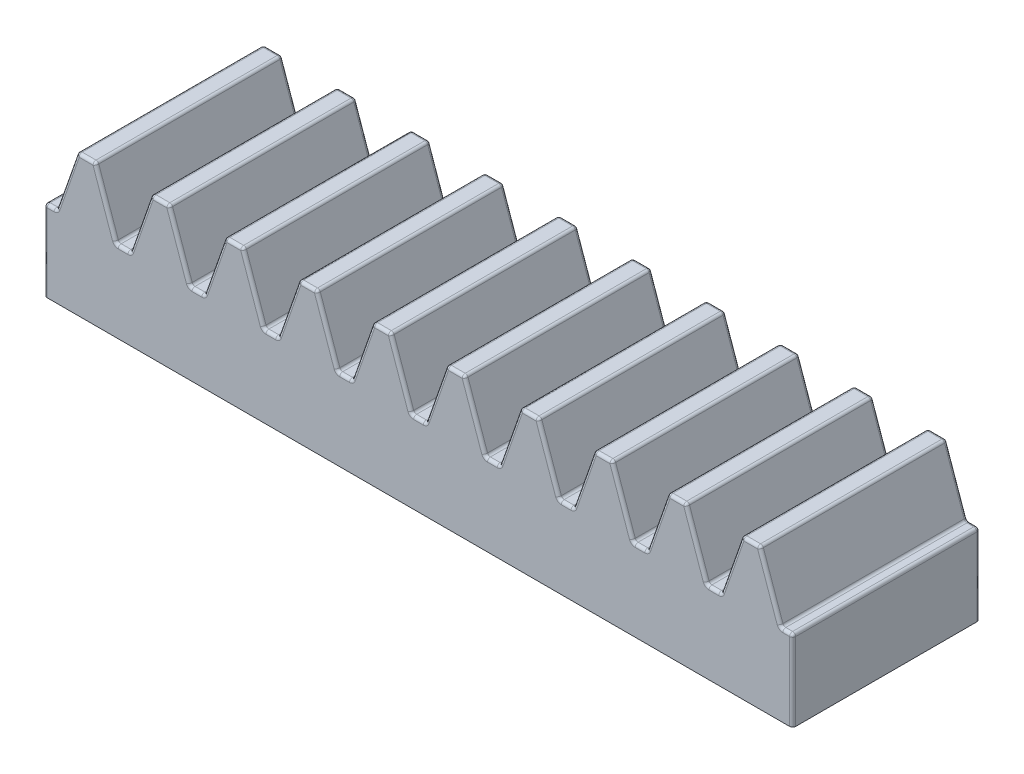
from build123d import *

# Parameters (mm, degrees)
SKETCH1_W              = 31.75
SKETCH1_H              = 3.429
BASE_EXTRUDE_DEPTH     = 3.96875
BOSS_EXTRUDE1_DEPTH    = 7.9375
FILLET1_R              = 0.127
LPATTERN1_COUNT        = 10
LPATTERN1_PITCH        = 3.132666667
FILLET1_OF_LPATTERN1_R = 0.127
FILLET2_R              = 0.127
SKETCH3_W              = 28.575
SKETCH3_H              = 4.7625
CUT_EXTRUDE1_DEPTH     = 2.54
BOSS_EXTRUDE2_REACH    = 19.418
SKETCH4_R              = 1.27
LPATTERN2_COUNT        = 3
LPATTERN2_PITCH        = 7.9375


with BuildPart() as part:
    # Sketch1 → Base-Extrude (new, symmetric)
    with BuildSketch(Plane.XY):
        with Locations((0, 1.7145)):
            Rectangle(SKETCH1_W, SKETCH1_H)
    extrude(amount=BASE_EXTRUDE_DEPTH, both=True)

    # Sketch2 → Boss-Extrude1 (add, through all)
    with BuildSketch(Plane.XY.offset(3.96875)):
        Polygon((-15.367, 3.429), (-14.478, 5.969), (-13.716, 5.969), (-12.827, 3.429), align=None)
    boss_extrude1 = extrude(amount=-BOSS_EXTRUDE1_DEPTH)

    # Fillet1
    fillet1_edges = [part.edges().sort_by_distance(p)[0] for p in [
        (-12.827, 3.429, 0),
        (-15.367, 3.429, 0),
        (-14.478, 5.969, 0),
        (-13.716, 5.969, 0),
    ]]
    fillet(fillet1_edges, radius=FILLET1_R)

    # LPattern1: Boss-Extrude1 ×10
    with Locations(*[(i * LPATTERN1_PITCH, 0, 0) for i in range(1, LPATTERN1_COUNT)]):
        add(boss_extrude1)

    # Fillet1 of LPattern1
    fillet1_of_lpattern1_edges = [part.edges().sort_by_distance(p)[0] for p in [
        (-9.694333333, 3.429, 0),
        (-12.234333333, 3.429, 0),
        (-11.345333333, 5.969, 0),
        (-10.583333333, 5.969, 0),
        (-6.561666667, 3.429, 0),
        (-9.101666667, 3.429, 0),
        (-8.212666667, 5.969, 0),
        (-7.450666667, 5.969, 0),
        (-3.429, 3.429, 0),
        (-5.969, 3.429, 0),
        (-5.08, 5.969, 0),
        (-4.318, 5.969, 0),
        (-0.296333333, 3.429, 0),
        (-2.836333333, 3.429, 0),
        (-1.947333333, 5.969, 0),
        (-1.185333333, 5.969, 0),
        (2.836333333, 3.429, 0),
        (0.296333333, 3.429, 0),
        (1.185333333, 5.969, 0),
        (1.947333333, 5.969, 0),
        (5.969, 3.429, 0),
        (3.429, 3.429, 0),
        (4.318, 5.969, 0),
        (5.08, 5.969, 0),
        (9.101666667, 3.429, 0),
        (6.561666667, 3.429, 0),
        (7.450666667, 5.969, 0),
        (8.212666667, 5.969, 0),
        (12.234333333, 3.429, 0),
        (9.694333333, 3.429, 0),
        (10.583333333, 5.969, 0),
        (11.345333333, 5.969, 0),
        (15.367, 3.429, 0),
        (12.827, 3.429, 0),
        (13.716, 5.969, 0),
        (14.478, 5.969, 0),
    ]]
    fillet(fillet1_of_lpattern1_edges, radius=FILLET1_OF_LPATTERN1_R)

    # Fillet2
    fillet2_edges = [part.edges().sort_by_distance(p)[0] for p in [
        (15.875, 1.7145, 3.96875),
        (-15.666052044, 3.429, 3.96875),
        (-11.789833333, 4.699, 3.96875),
        (-11.789833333, 4.699, -3.96875),
        (-10.964333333, 5.969, 3.96875),
        (-10.964333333, 5.969, -3.96875),
        (-9.398, 3.429, 3.96875),
        (-10.138833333, 4.699, 3.96875),
        (-10.138833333, 4.699, -3.96875),
        (-9.398, 3.429, -3.96875),
        (-12.250950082, 3.452420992, 3.96875),
        (-12.250950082, 3.452420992, -3.96875),
        (-9.677716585, 3.452420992, 3.96875),
        (-9.677716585, 3.452420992, -3.96875),
        (-8.657166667, 4.699, 3.96875),
        (-8.657166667, 4.699, -3.96875),
        (-7.831666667, 5.969, 3.96875),
        (-7.831666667, 5.969, -3.96875),
        (-6.265333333, 3.429, 3.96875),
        (-7.006166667, 4.699, 3.96875),
        (-7.006166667, 4.699, -3.96875),
        (-6.265333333, 3.429, -3.96875),
        (-9.118283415, 3.452420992, 3.96875),
        (-9.118283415, 3.452420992, -3.96875),
        (-6.545049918, 3.452420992, 3.96875),
        (-6.545049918, 3.452420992, -3.96875),
        (-5.5245, 4.699, 3.96875),
        (-5.5245, 4.699, -3.96875),
        (-4.699, 5.969, 3.96875),
        (-4.699, 5.969, -3.96875),
        (-3.132666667, 3.429, 3.96875),
        (-3.8735, 4.699, 3.96875),
        (-3.8735, 4.699, -3.96875),
        (-3.132666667, 3.429, -3.96875),
        (-5.985616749, 3.452420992, 3.96875),
        (-5.985616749, 3.452420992, -3.96875),
        (-3.412383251, 3.452420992, 3.96875),
        (-3.412383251, 3.452420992, -3.96875),
        (-14.9225, 4.699, 3.96875),
        (-14.9225, 4.699, -3.96875),
        (-2.391833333, 4.699, 3.96875),
        (-2.391833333, 4.699, -3.96875),
        (-1.566333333, 5.969, 3.96875),
        (-1.566333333, 5.969, -3.96875),
        (0, 3.429, 3.96875),
        (-0.740833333, 4.699, 3.96875),
        (-0.740833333, 4.699, -3.96875),
        (0, 3.429, -3.96875),
        (-2.852950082, 3.452420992, 3.96875),
        (-2.852950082, 3.452420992, -3.96875),
        (-0.279716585, 3.452420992, 3.96875),
        (-0.279716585, 3.452420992, -3.96875),
        (-14.097, 5.969, 3.96875),
        (-14.097, 5.969, -3.96875),
        (0.740833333, 4.699, 3.96875),
        (0.740833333, 4.699, -3.96875),
        (1.566333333, 5.969, 3.96875),
        (1.566333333, 5.969, -3.96875),
        (3.132666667, 3.429, 3.96875),
        (2.391833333, 4.699, 3.96875),
        (-12.530666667, 3.429, 3.96875),
        (2.391833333, 4.699, -3.96875),
        (3.132666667, 3.429, -3.96875),
        (-13.2715, 4.699, 3.96875),
        (0.279716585, 3.452420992, 3.96875),
        (0.279716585, 3.452420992, -3.96875),
        (2.852950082, 3.452420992, 3.96875),
        (2.852950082, 3.452420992, -3.96875),
        (-13.2715, 4.699, -3.96875),
        (-12.530666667, 3.429, -3.96875),
        (3.8735, 4.699, 3.96875),
        (3.8735, 4.699, -3.96875),
        (4.699, 5.969, 3.96875),
        (4.699, 5.969, -3.96875),
        (6.265333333, 3.429, 3.96875),
        (5.5245, 4.699, 3.96875),
        (5.5245, 4.699, -3.96875),
        (6.265333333, 3.429, -3.96875),
        (3.412383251, 3.452420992, 3.96875),
        (3.412383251, 3.452420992, -3.96875),
        (5.985616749, 3.452420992, 3.96875),
        (5.985616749, 3.452420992, -3.96875),
        (-15.875, 1.7145, 3.96875),
        (-15.383616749, 3.452420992, 3.96875),
        (-15.383616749, 3.452420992, -3.96875),
        (-12.810383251, 3.452420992, 3.96875),
        (7.006166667, 4.699, 3.96875),
        (7.006166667, 4.699, -3.96875),
        (-12.810383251, 3.452420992, -3.96875),
        (7.831666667, 5.969, 3.96875),
        (7.831666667, 5.969, -3.96875),
        (9.398, 3.429, 3.96875),
        (8.657166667, 4.699, 3.96875),
        (8.657166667, 4.699, -3.96875),
        (9.398, 3.429, -3.96875),
        (6.545049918, 3.452420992, 3.96875),
        (6.545049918, 3.452420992, -3.96875),
        (9.118283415, 3.452420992, 3.96875),
        (9.118283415, 3.452420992, -3.96875),
        (-15.666052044, 3.429, -3.96875),
        (10.138833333, 4.699, 3.96875),
        (10.138833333, 4.699, -3.96875),
        (10.964333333, 5.969, 3.96875),
        (10.964333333, 5.969, -3.96875),
        (12.530666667, 3.429, 3.96875),
        (11.789833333, 4.699, 3.96875),
        (11.789833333, 4.699, -3.96875),
        (12.530666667, 3.429, -3.96875),
        (9.677716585, 3.452420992, 3.96875),
        (9.677716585, 3.452420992, -3.96875),
        (12.250950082, 3.452420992, 3.96875),
        (12.250950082, 3.452420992, -3.96875),
        (15.875, 1.7145, -3.96875),
        (13.2715, 4.699, 3.96875),
        (13.2715, 4.699, -3.96875),
        (14.097, 5.969, 3.96875),
        (14.097, 5.969, -3.96875),
        (15.666052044, 3.429, 3.96875),
        (14.9225, 4.699, 3.96875),
        (14.9225, 4.699, -3.96875),
        (15.666052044, 3.429, -3.96875),
        (12.810383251, 3.452420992, 3.96875),
        (12.810383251, 3.452420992, -3.96875),
        (15.383616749, 3.452420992, 3.96875),
        (15.383616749, 3.452420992, -3.96875),
        (-15.875, 1.7145, -3.96875),
        (-15.875, 3.429, 0),
        (15.875, 3.429, 0),
    ]]
    fillet(fillet2_edges, radius=FILLET2_R)

    # Sketch3 → Cut-Extrude1 (cut)
    with BuildSketch(Plane.XZ):
        Rectangle(SKETCH3_W, SKETCH3_H)
    extrude(amount=-CUT_EXTRUDE1_DEPTH, mode=Mode.SUBTRACT)

    # Sketch4 → Boss-Extrude2 (add, up to next)
    with BuildSketch(Plane.XZ, mode=Mode.PRIVATE) as boss_extrude2_sk1:
        with Locations((-7.9375, 0)):
            Circle(SKETCH4_R)
    boss_extrude2_tool1 = extrude(boss_extrude2_sk1.sketch, amount=-BOSS_EXTRUDE2_REACH, mode=Mode.PRIVATE) - part.part
    boss_extrude2 = boss_extrude2_tool1.solids().sort_by_distance((-7.9375, 0, 0))[0]
    add(boss_extrude2)

    # LPattern2: Boss-Extrude2 ×3
    with Locations(*[(i * LPATTERN2_PITCH, 0, 0) for i in range(1, LPATTERN2_COUNT)]):
        add(boss_extrude2)


solid = part.part
